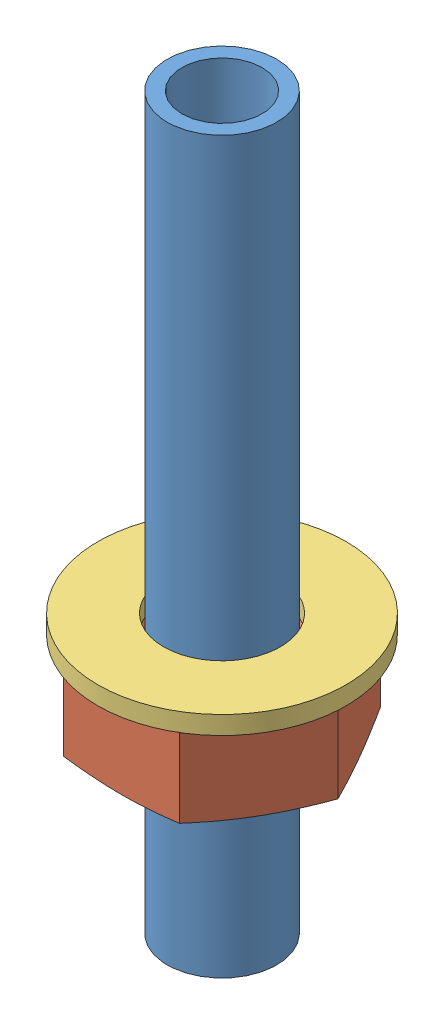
SolidWorks assembly BellcrankTube.SLDASM, configuration Default (file format 3100). Lengths in mm.
Overall size (6.8 20 6.8).
3 component instances, 3 part files, 4 mates.
Components (placement in the parent):
- BrassTube1-1: BrassTube1.SLDPRT [Default] at origin size (3 20 3)
- Nut-1: Nut.SLDPRT [Default] at (0 4.6 0) size (6.35 2.5 5.5)
- M3-washer-1: M3-washer.SLDPRT [Default] at (0 7.1 0) size (6.8 0.5 6.8)
Mates (geometry in assembly coordinates):
- Concentric1: concentric aligned: cylinder of BrassTube1-1; cylinder of Nut-1
- Concentric2: concentric aligned: cylinder of BrassTube1-1; cylinder of M3-washer-1
- Coincident1: coincident anti-aligned: plane of Nut-1 through (-4.7631 7.1 -2.75) normal (0 1 0); plane of M3-washer-1 through (0 7.1 0) normal (0 -1 0)
- Distance1: distance = 12.4 mm aligned: plane of BrassTube1-1 through (0 20 0) normal (0 1 0); plane of M3-washer-1 through (0 7.6 0) normal (0 1 0)
